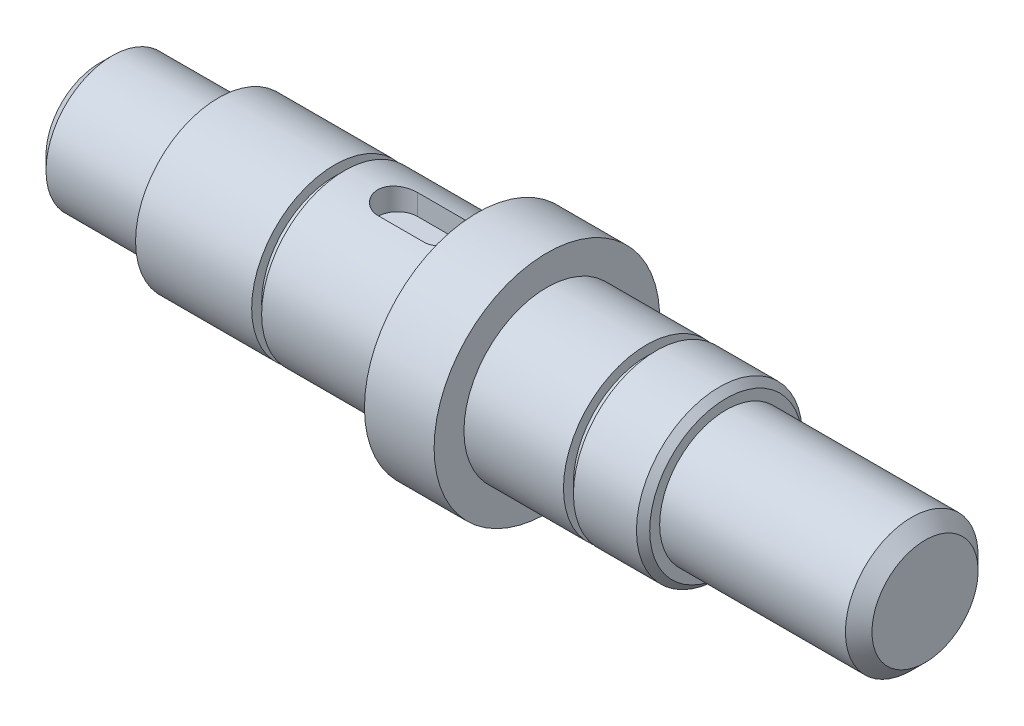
ISO-10303-21;
HEADER;
FILE_DESCRIPTION(('STEP AP214'),'2;1');
FILE_NAME('part.step','',(''),(''),'','','');
FILE_SCHEMA(('AUTOMOTIVE_DESIGN { 1 0 10303 214 1 1 1 1 }'));
ENDSEC;
DATA;
#1=APPLICATION_CONTEXT('core data for automotive mechanical design processes');
#2=APPLICATION_PROTOCOL_DEFINITION('international standard','automotive_design',2000,#1);
#3=PRODUCT_CONTEXT('',#1,'mechanical');
#4=PRODUCT('Part','Part','',(#3));
#5=PRODUCT_RELATED_PRODUCT_CATEGORY('part','',(#4));
#6=PRODUCT_DEFINITION_FORMATION('','',#4);
#7=PRODUCT_DEFINITION_CONTEXT('part definition',#1,'design');
#8=PRODUCT_DEFINITION('design','',#6,#7);
#9=PRODUCT_DEFINITION_SHAPE('','',#8);
#10=(LENGTH_UNIT() NAMED_UNIT(*) SI_UNIT(.MILLI.,.METRE.));
#11=(NAMED_UNIT(*) PLANE_ANGLE_UNIT() SI_UNIT($,.RADIAN.));
#12=(NAMED_UNIT(*) SI_UNIT($,.STERADIAN.) SOLID_ANGLE_UNIT());
#13=UNCERTAINTY_MEASURE_WITH_UNIT(LENGTH_MEASURE(1.E-05),#10,'distance_accuracy_value','');
#14=(GEOMETRIC_REPRESENTATION_CONTEXT(3) GLOBAL_UNCERTAINTY_ASSIGNED_CONTEXT((#13)) GLOBAL_UNIT_ASSIGNED_CONTEXT((#10,
#11,#12)) REPRESENTATION_CONTEXT('',''));
#15=CARTESIAN_POINT('',(0.,0.,0.));
#16=DIRECTION('',(0.,0.,1.));
#17=DIRECTION('',(1.,0.,0.));
#18=AXIS2_PLACEMENT_3D('',#15,#16,#17);
#19=CARTESIAN_POINT('',(-69.5,0.,0.));
#20=DIRECTION('',(1.,0.,0.));
#21=DIRECTION('',(0.,0.,-1.));
#22=AXIS2_PLACEMENT_3D('',#19,#20,#21);
#23=PLANE('',#22);
#24=CARTESIAN_POINT('',(-69.5,0.,0.));
#25=DIRECTION('',(1.,0.,0.));
#26=DIRECTION('',(0.,0.,-1.));
#27=AXIS2_PLACEMENT_3D('',#24,#25,#26);
#28=CIRCLE('',#27,7.99999999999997);
#29=CARTESIAN_POINT('',(-69.5,0.,-7.99999999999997));
#30=VERTEX_POINT('',#29);
#31=EDGE_CURVE('E150',#30,#30,#28,.F.);
#32=ORIENTED_EDGE('',*,*,#31,.T.);
#33=EDGE_LOOP('',(#32));
#34=FACE_BOUND('',#33,.T.);
#35=ADVANCED_FACE('F33',(#34),#23,.F.);
#36=CARTESIAN_POINT('',(-69.5,0.,0.));
#37=DIRECTION('',(-1.,0.,0.));
#38=DIRECTION('',(0.,0.,1.));
#39=AXIS2_PLACEMENT_3D('',#36,#37,#38);
#40=CYLINDRICAL_SURFACE('',#39,10.);
#41=CARTESIAN_POINT('',(-67.5,0.,0.));
#42=DIRECTION('',(1.,0.,0.));
#43=DIRECTION('',(0.,0.,-1.));
#44=AXIS2_PLACEMENT_3D('',#41,#42,#43);
#45=CIRCLE('',#44,10.);
#46=CARTESIAN_POINT('',(-67.5,0.,-10.));
#47=VERTEX_POINT('',#46);
#48=EDGE_CURVE('E153',#47,#47,#45,.T.);
#49=ORIENTED_EDGE('',*,*,#48,.T.);
#50=EDGE_LOOP('',(#49));
#51=FACE_BOUND('',#50,.T.);
#52=CARTESIAN_POINT('',(-51.5,0.,0.));
#53=DIRECTION('',(-1.,0.,0.));
#54=DIRECTION('',(0.,0.,1.));
#55=AXIS2_PLACEMENT_3D('',#52,#53,#54);
#56=CIRCLE('',#55,10.);
#57=CARTESIAN_POINT('',(-51.5,0.,10.));
#58=VERTEX_POINT('',#57);
#59=EDGE_CURVE('E147',#58,#58,#56,.T.);
#60=ORIENTED_EDGE('',*,*,#59,.T.);
#61=EDGE_LOOP('',(#60));
#62=FACE_BOUND('',#61,.T.);
#63=ADVANCED_FACE('F254',(#51,#62),#40,.T.);
#64=CARTESIAN_POINT('',(-51.5,10.,0.));
#65=DIRECTION('',(1.,0.,0.));
#66=DIRECTION('',(0.,0.,-1.));
#67=AXIS2_PLACEMENT_3D('',#64,#65,#66);
#68=PLANE('',#67);
#69=ORIENTED_EDGE('',*,*,#59,.F.);
#70=EDGE_LOOP('',(#69));
#71=FACE_BOUND('',#70,.T.);
#72=CARTESIAN_POINT('',(-51.5,0.,0.));
#73=DIRECTION('',(-1.,0.,0.));
#74=DIRECTION('',(0.,0.,1.));
#75=AXIS2_PLACEMENT_3D('',#72,#73,#74);
#76=CIRCLE('',#75,12.5);
#77=CARTESIAN_POINT('',(-51.5,0.,12.5));
#78=VERTEX_POINT('',#77);
#79=EDGE_CURVE('E144',#78,#78,#76,.T.);
#80=ORIENTED_EDGE('',*,*,#79,.T.);
#81=EDGE_LOOP('',(#80));
#82=FACE_BOUND('',#81,.T.);
#83=ADVANCED_FACE('F259',(#71,#82),#68,.F.);
#84=CARTESIAN_POINT('',(-69.5,0.,0.));
#85=DIRECTION('',(-1.,0.,0.));
#86=DIRECTION('',(0.,0.,1.));
#87=AXIS2_PLACEMENT_3D('',#84,#85,#86);
#88=CYLINDRICAL_SURFACE('',#87,12.5);
#89=ORIENTED_EDGE('',*,*,#79,.F.);
#90=EDGE_LOOP('',(#89));
#91=FACE_BOUND('',#90,.T.);
#92=CARTESIAN_POINT('',(-34.,0.,0.));
#93=DIRECTION('',(-1.,0.,0.));
#94=DIRECTION('',(0.,0.,1.));
#95=AXIS2_PLACEMENT_3D('',#92,#93,#94);
#96=CIRCLE('',#95,12.5);
#97=CARTESIAN_POINT('',(-34.,0.,12.5));
#98=VERTEX_POINT('',#97);
#99=EDGE_CURVE('E141',#98,#98,#96,.T.);
#100=ORIENTED_EDGE('',*,*,#99,.T.);
#101=EDGE_LOOP('',(#100));
#102=FACE_BOUND('',#101,.T.);
#103=ADVANCED_FACE('F266',(#91,#102),#88,.T.);
#104=CARTESIAN_POINT('',(-34.,11.,0.));
#105=DIRECTION('',(-1.,0.,0.));
#106=DIRECTION('',(0.,0.,1.));
#107=AXIS2_PLACEMENT_3D('',#104,#105,#106);
#108=PLANE('',#107);
#109=ORIENTED_EDGE('',*,*,#99,.F.);
#110=EDGE_LOOP('',(#109));
#111=FACE_BOUND('',#110,.T.);
#112=CARTESIAN_POINT('',(-34.,0.,0.));
#113=DIRECTION('',(-1.,0.,0.));
#114=DIRECTION('',(0.,0.,1.));
#115=AXIS2_PLACEMENT_3D('',#112,#113,#114);
#116=CIRCLE('',#115,11.);
#117=CARTESIAN_POINT('',(-34.,0.,11.));
#118=VERTEX_POINT('',#117);
#119=EDGE_CURVE('E138',#118,#118,#116,.T.);
#120=ORIENTED_EDGE('',*,*,#119,.T.);
#121=EDGE_LOOP('',(#120));
#122=FACE_BOUND('',#121,.T.);
#123=ADVANCED_FACE('F273',(#111,#122),#108,.F.);
#124=CARTESIAN_POINT('',(-69.5,0.,0.));
#125=DIRECTION('',(-1.,0.,0.));
#126=DIRECTION('',(0.,0.,1.));
#127=AXIS2_PLACEMENT_3D('',#124,#125,#126);
#128=CYLINDRICAL_SURFACE('',#127,11.);
#129=ORIENTED_EDGE('',*,*,#119,.F.);
#130=EDGE_LOOP('',(#129));
#131=FACE_BOUND('',#130,.T.);
#132=CARTESIAN_POINT('',(-32.5,0.,0.));
#133=DIRECTION('',(-1.,0.,0.));
#134=DIRECTION('',(0.,0.,1.));
#135=AXIS2_PLACEMENT_3D('',#132,#133,#134);
#136=CIRCLE('',#135,11.);
#137=CARTESIAN_POINT('',(-32.5,0.,11.));
#138=VERTEX_POINT('',#137);
#139=EDGE_CURVE('E135',#138,#138,#136,.T.);
#140=ORIENTED_EDGE('',*,*,#139,.T.);
#141=EDGE_LOOP('',(#140));
#142=FACE_BOUND('',#141,.T.);
#143=ADVANCED_FACE('F277',(#131,#142),#128,.T.);
#144=CARTESIAN_POINT('',(-32.5,12.5,0.));
#145=DIRECTION('',(1.,0.,0.));
#146=DIRECTION('',(0.,0.,-1.));
#147=AXIS2_PLACEMENT_3D('',#144,#145,#146);
#148=PLANE('',#147);
#149=ORIENTED_EDGE('',*,*,#139,.F.);
#150=EDGE_LOOP('',(#149));
#151=FACE_BOUND('',#150,.T.);
#152=CARTESIAN_POINT('',(-32.5,0.,0.));
#153=DIRECTION('',(-1.,0.,0.));
#154=DIRECTION('',(0.,0.,1.));
#155=AXIS2_PLACEMENT_3D('',#152,#153,#154);
#156=CIRCLE('',#155,12.5);
#157=CARTESIAN_POINT('',(-32.5,0.,12.5));
#158=VERTEX_POINT('',#157);
#159=EDGE_CURVE('E132',#158,#158,#156,.T.);
#160=ORIENTED_EDGE('',*,*,#159,.T.);
#161=EDGE_LOOP('',(#160));
#162=FACE_BOUND('',#161,.T.);
#163=ADVANCED_FACE('F249',(#151,#162),#148,.F.);
#164=CARTESIAN_POINT('',(-69.5,0.,0.));
#165=DIRECTION('',(-1.,0.,0.));
#166=DIRECTION('',(0.,0.,1.));
#167=AXIS2_PLACEMENT_3D('',#164,#165,#166);
#168=CYLINDRICAL_SURFACE('',#167,12.5);
#169=DIRECTION('',(-1.,0.,0.));
#170=VECTOR('',#169,1.);
#171=CARTESIAN_POINT('',(-69.5,12.1346610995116,-3.));
#172=LINE('',#171,#170);
#173=CARTESIAN_POINT('',(-24.5,12.1346610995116,-3.));
#174=VERTEX_POINT('',#173);
#175=CARTESIAN_POINT('',(-17.5,12.1346610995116,-3.));
#176=VERTEX_POINT('',#175);
#177=EDGE_CURVE('E168',#174,#176,#172,.F.);
#178=ORIENTED_EDGE('',*,*,#177,.T.);
#179=CARTESIAN_POINT('',(-17.5,12.1346610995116,-3.));
#180=CARTESIAN_POINT('',(-17.416922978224,12.1346522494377,-3.00000949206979));
#181=CARTESIAN_POINT('',(-17.3338515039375,12.1355140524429,-2.9965492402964));
#182=CARTESIAN_POINT('',(-17.1683275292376,12.1389133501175,-2.98276295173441));
#183=CARTESIAN_POINT('',(-17.0858749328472,12.1414505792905,-2.97243800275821));
#184=CARTESIAN_POINT('',(-16.9223234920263,12.1481288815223,-2.94502172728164));
#185=CARTESIAN_POINT('',(-16.8412223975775,12.1522669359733,-2.92794313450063));
#186=CARTESIAN_POINT('',(-16.6808118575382,12.1620165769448,-2.88717657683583));
#187=CARTESIAN_POINT('',(-16.6015024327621,12.1676281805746,-2.86348853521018));
#188=CARTESIAN_POINT('',(-16.3670985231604,12.1864398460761,-2.7827647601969));
#189=CARTESIAN_POINT('',(-16.2153717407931,12.2016236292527,-2.71604288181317));
#190=CARTESIAN_POINT('',(-15.9253044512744,12.2355556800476,-2.55882843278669));
#191=CARTESIAN_POINT('',(-15.7869670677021,12.2543047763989,-2.46833033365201));
#192=CARTESIAN_POINT('',(-15.5247427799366,12.2936784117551,-2.26416625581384));
#193=CARTESIAN_POINT('',(-15.4011634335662,12.3143307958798,-2.15010988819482));
#194=CARTESIAN_POINT('',(-15.1746900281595,12.3549430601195,-1.90290471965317));
#195=CARTESIAN_POINT('',(-15.0717992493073,12.3749028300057,-1.76975289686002));
#196=CARTESIAN_POINT('',(-14.8883717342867,12.4121880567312,-1.48603085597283));
#197=CARTESIAN_POINT('',(-14.8081375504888,12.4294765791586,-1.33525974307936));
#198=CARTESIAN_POINT('',(-14.6742706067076,12.4591517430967,-1.0218953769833));
#199=CARTESIAN_POINT('',(-14.6206328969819,12.4715392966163,-0.859304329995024));
#200=CARTESIAN_POINT('',(-14.5424623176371,12.4898199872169,-0.530138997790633));
#201=CARTESIAN_POINT('',(-14.5174033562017,12.4958303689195,-0.363696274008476));
#202=CARTESIAN_POINT('',(-14.4954524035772,12.5010873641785,-0.0288643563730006));
#203=CARTESIAN_POINT('',(-14.4985571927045,12.5003347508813,0.139524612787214));
#204=CARTESIAN_POINT('',(-14.5324637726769,12.4922383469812,0.469819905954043));
#205=CARTESIAN_POINT('',(-14.5626973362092,12.4850297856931,0.631788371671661));
#206=CARTESIAN_POINT('',(-14.6490922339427,12.464987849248,0.948281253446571));
#207=CARTESIAN_POINT('',(-14.7052546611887,12.4521542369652,1.10280535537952));
#208=CARTESIAN_POINT('',(-14.8423876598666,12.4220935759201,1.40155039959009));
#209=CARTESIAN_POINT('',(-14.9235651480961,12.4048300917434,1.54567254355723));
#210=CARTESIAN_POINT('',(-15.1082662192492,12.3677898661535,1.81844702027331));
#211=CARTESIAN_POINT('',(-15.2117928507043,12.3480127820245,1.94709723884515));
#212=CARTESIAN_POINT('',(-15.4413012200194,12.307525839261,2.18865245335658));
#213=CARTESIAN_POINT('',(-15.5677774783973,12.2868050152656,2.30108617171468));
#214=CARTESIAN_POINT('',(-15.8380442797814,12.2472145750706,2.50327463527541));
#215=CARTESIAN_POINT('',(-15.9818395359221,12.2283454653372,2.59302318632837));
#216=CARTESIAN_POINT('',(-16.2835552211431,12.1945549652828,2.74756993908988));
#217=CARTESIAN_POINT('',(-16.4415389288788,12.1796525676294,2.81224875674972));
#218=CARTESIAN_POINT('',(-16.7664841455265,12.1557369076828,2.91390343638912));
#219=CARTESIAN_POINT('',(-16.9334318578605,12.1467148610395,2.95092063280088));
#220=CARTESIAN_POINT('',(-17.1681685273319,12.139016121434,2.98233825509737));
#221=CARTESIAN_POINT('',(-17.2344069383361,12.1373853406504,2.98896283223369));
#222=CARTESIAN_POINT('',(-17.3670865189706,12.1352084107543,2.9977885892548));
#223=CARTESIAN_POINT('',(-17.4335271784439,12.1346604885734,2.99999700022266));
#224=CARTESIAN_POINT('',(-17.5,12.1346610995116,3.));
#225=B_SPLINE_CURVE_WITH_KNOTS('',3,(#179,#180,#181,#182,#183,#184,#185,#186,#187,#188,#189,
#190,#191,#192,#193,#194,#195,#196,#197,#198,#199,#200,#201,#202,#203,#204,#205,#206,#207,#208,
#209,#210,#211,#212,#213,#214,#215,#216,#217,#218,#219,#220,#221,#222,#223,#224),.UNSPECIFIED.,
.F.,.F.,(4,2,2,2,2,2,2,2,2,2,2,2,2,2,2,2,2,2,2,2,2,2,4),(0.,0.249144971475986,0.49825047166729,
0.746888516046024,0.995529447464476,1.49234020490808,1.98926658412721,2.49520478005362,
3.00122312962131,3.51370966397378,4.02610078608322,4.52889907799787,5.03163989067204,
5.52409016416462,6.01656119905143,6.51322041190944,7.00994741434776,7.51903074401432,
8.02825292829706,8.5398711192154,9.05072326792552,9.2503660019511,9.44968157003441),.UNSPECIFIED.);
#226=CARTESIAN_POINT('',(-17.5,12.1346610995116,3.));
#227=VERTEX_POINT('',#226);
#228=EDGE_CURVE('E11',#176,#227,#225,.T.);
#229=ORIENTED_EDGE('',*,*,#228,.T.);
#230=DIRECTION('',(-1.,0.,0.));
#231=VECTOR('',#230,1.);
#232=CARTESIAN_POINT('',(-69.5,12.1346610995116,3.));
#233=LINE('',#232,#231);
#234=CARTESIAN_POINT('',(-24.5,12.1346610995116,3.));
#235=VERTEX_POINT('',#234);
#236=EDGE_CURVE('E45',#227,#235,#233,.T.);
#237=ORIENTED_EDGE('',*,*,#236,.T.);
#238=CARTESIAN_POINT('',(-24.5,12.1346610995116,3.));
#239=CARTESIAN_POINT('',(-24.583077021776,12.1346522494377,3.00000949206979));
#240=CARTESIAN_POINT('',(-24.6661484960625,12.1355140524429,2.9965492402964));
#241=CARTESIAN_POINT('',(-24.8316724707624,12.1389133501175,2.9827629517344));
#242=CARTESIAN_POINT('',(-24.9141250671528,12.1414505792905,2.97243800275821));
#243=CARTESIAN_POINT('',(-25.0776765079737,12.1481288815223,2.94502172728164));
#244=CARTESIAN_POINT('',(-25.1587776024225,12.1522669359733,2.92794313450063));
#245=CARTESIAN_POINT('',(-25.3191881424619,12.1620165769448,2.88717657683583));
#246=CARTESIAN_POINT('',(-25.3984975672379,12.1676281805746,2.86348853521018));
#247=CARTESIAN_POINT('',(-25.6329014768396,12.1864398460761,2.7827647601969));
#248=CARTESIAN_POINT('',(-25.7846282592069,12.2016236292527,2.71604288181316));
#249=CARTESIAN_POINT('',(-26.0746955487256,12.2355556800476,2.55882843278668));
#250=CARTESIAN_POINT('',(-26.2130329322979,12.2543047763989,2.46833033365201));
#251=CARTESIAN_POINT('',(-26.4752572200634,12.2936784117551,2.26416625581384));
#252=CARTESIAN_POINT('',(-26.5988365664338,12.3143307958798,2.15010988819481));
#253=CARTESIAN_POINT('',(-26.8253099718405,12.3549430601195,1.90290471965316));
#254=CARTESIAN_POINT('',(-26.9282007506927,12.3749028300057,1.76975289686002));
#255=CARTESIAN_POINT('',(-27.1116282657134,12.4121880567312,1.48603085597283));
#256=CARTESIAN_POINT('',(-27.1918624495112,12.4294765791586,1.33525974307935));
#257=CARTESIAN_POINT('',(-27.3257293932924,12.4591517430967,1.02189537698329));
#258=CARTESIAN_POINT('',(-27.3793671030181,12.4715392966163,0.859304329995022));
#259=CARTESIAN_POINT('',(-27.4575376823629,12.4898199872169,0.530138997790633));
#260=CARTESIAN_POINT('',(-27.4825966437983,12.4958303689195,0.363696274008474));
#261=CARTESIAN_POINT('',(-27.5045475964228,12.5010873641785,0.0288643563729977));
#262=CARTESIAN_POINT('',(-27.5014428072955,12.5003347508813,-0.139524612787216));
#263=CARTESIAN_POINT('',(-27.4675362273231,12.4922383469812,-0.469819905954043));
#264=CARTESIAN_POINT('',(-27.4373026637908,12.4850297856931,-0.631788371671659));
#265=CARTESIAN_POINT('',(-27.3509077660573,12.464987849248,-0.948281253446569));
#266=CARTESIAN_POINT('',(-27.2947453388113,12.4521542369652,-1.10280535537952));
#267=CARTESIAN_POINT('',(-27.1576123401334,12.4220935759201,-1.40155039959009));
#268=CARTESIAN_POINT('',(-27.0764348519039,12.4048300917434,-1.54567254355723));
#269=CARTESIAN_POINT('',(-26.8917337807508,12.3677898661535,-1.81844702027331));
#270=CARTESIAN_POINT('',(-26.7882071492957,12.3480127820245,-1.94709723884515));
#271=CARTESIAN_POINT('',(-26.5586987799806,12.307525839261,-2.18865245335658));
#272=CARTESIAN_POINT('',(-26.4322225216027,12.2868050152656,-2.30108617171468));
#273=CARTESIAN_POINT('',(-26.1619557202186,12.2472145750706,-2.50327463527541));
#274=CARTESIAN_POINT('',(-26.0181604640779,12.2283454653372,-2.59302318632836));
#275=CARTESIAN_POINT('',(-25.7164447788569,12.1945549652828,-2.74756993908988));
#276=CARTESIAN_POINT('',(-25.5584610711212,12.1796525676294,-2.81224875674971));
#277=CARTESIAN_POINT('',(-25.2335158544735,12.1557369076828,-2.91390343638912));
#278=CARTESIAN_POINT('',(-25.0665681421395,12.1467148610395,-2.95092063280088));
#279=CARTESIAN_POINT('',(-24.831831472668,12.139016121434,-2.98233825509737));
#280=CARTESIAN_POINT('',(-24.7655930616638,12.1373853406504,-2.98896283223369));
#281=CARTESIAN_POINT('',(-24.6329134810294,12.1352084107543,-2.9977885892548));
#282=CARTESIAN_POINT('',(-24.5664728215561,12.1346604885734,-2.99999700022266));
#283=CARTESIAN_POINT('',(-24.5,12.1346610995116,-3.));
#284=B_SPLINE_CURVE_WITH_KNOTS('',3,(#238,#239,#240,#241,#242,#243,#244,#245,#246,#247,#248,
#249,#250,#251,#252,#253,#254,#255,#256,#257,#258,#259,#260,#261,#262,#263,#264,#265,#266,#267,
#268,#269,#270,#271,#272,#273,#274,#275,#276,#277,#278,#279,#280,#281,#282,#283),.UNSPECIFIED.,
.F.,.F.,(4,2,2,2,2,2,2,2,2,2,2,2,2,2,2,2,2,2,2,2,2,2,4),(0.,0.249144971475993,0.4982504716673,
0.746888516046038,0.995529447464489,1.49234020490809,1.98926658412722,2.49520478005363,
3.00122312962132,3.51370966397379,4.02610078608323,4.52889907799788,5.03163989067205,
5.52409016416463,6.01656119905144,6.51322041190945,7.00994741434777,7.51903074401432,
8.02825292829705,8.5398711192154,9.05072326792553,9.25036600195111,9.44968157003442),.UNSPECIFIED.);
#285=EDGE_CURVE('E170',#235,#174,#284,.T.);
#286=ORIENTED_EDGE('',*,*,#285,.T.);
#287=EDGE_LOOP('',(#178,#229,#237,#286));
#288=FACE_BOUND('',#287,.T.);
#289=ORIENTED_EDGE('',*,*,#159,.F.);
#290=EDGE_LOOP('',(#289));
#291=FACE_BOUND('',#290,.T.);
#292=CARTESIAN_POINT('',(-12.5,0.,0.));
#293=DIRECTION('',(-1.,0.,0.));
#294=DIRECTION('',(0.,0.,1.));
#295=AXIS2_PLACEMENT_3D('',#292,#293,#294);
#296=CIRCLE('',#295,12.5);
#297=CARTESIAN_POINT('',(-12.5,0.,12.5));
#298=VERTEX_POINT('',#297);
#299=EDGE_CURVE('E129',#298,#298,#296,.T.);
#300=ORIENTED_EDGE('',*,*,#299,.T.);
#301=EDGE_LOOP('',(#300));
#302=FACE_BOUND('',#301,.T.);
#303=ADVANCED_FACE('F176',(#288,#291,#302),#168,.T.);
#304=CARTESIAN_POINT('',(-12.5,12.5,0.));
#305=DIRECTION('',(1.,0.,0.));
#306=DIRECTION('',(0.,0.,-1.));
#307=AXIS2_PLACEMENT_3D('',#304,#305,#306);
#308=PLANE('',#307);
#309=ORIENTED_EDGE('',*,*,#299,.F.);
#310=EDGE_LOOP('',(#309));
#311=FACE_BOUND('',#310,.T.);
#312=CARTESIAN_POINT('',(-12.5,0.,0.));
#313=DIRECTION('',(-1.,0.,0.));
#314=DIRECTION('',(0.,0.,1.));
#315=AXIS2_PLACEMENT_3D('',#312,#313,#314);
#316=CIRCLE('',#315,17.);
#317=CARTESIAN_POINT('',(-12.5,0.,17.));
#318=VERTEX_POINT('',#317);
#319=EDGE_CURVE('E126',#318,#318,#316,.T.);
#320=ORIENTED_EDGE('',*,*,#319,.T.);
#321=EDGE_LOOP('',(#320));
#322=FACE_BOUND('',#321,.T.);
#323=ADVANCED_FACE('F242',(#311,#322),#308,.F.);
#324=CARTESIAN_POINT('',(-69.5,0.,0.));
#325=DIRECTION('',(-1.,0.,0.));
#326=DIRECTION('',(0.,0.,1.));
#327=AXIS2_PLACEMENT_3D('',#324,#325,#326);
#328=CYLINDRICAL_SURFACE('',#327,17.);
#329=ORIENTED_EDGE('',*,*,#319,.F.);
#330=EDGE_LOOP('',(#329));
#331=FACE_BOUND('',#330,.T.);
#332=CARTESIAN_POINT('',(-2.,0.,0.));
#333=DIRECTION('',(-1.,0.,0.));
#334=DIRECTION('',(0.,0.,1.));
#335=AXIS2_PLACEMENT_3D('',#332,#333,#334);
#336=CIRCLE('',#335,17.);
#337=CARTESIAN_POINT('',(-2.,0.,17.));
#338=VERTEX_POINT('',#337);
#339=EDGE_CURVE('E123',#338,#338,#336,.T.);
#340=ORIENTED_EDGE('',*,*,#339,.T.);
#341=EDGE_LOOP('',(#340));
#342=FACE_BOUND('',#341,.T.);
#343=ADVANCED_FACE('F239',(#331,#342),#328,.T.);
#344=CARTESIAN_POINT('',(-2.,17.,0.));
#345=DIRECTION('',(-1.,0.,0.));
#346=DIRECTION('',(0.,0.,1.));
#347=AXIS2_PLACEMENT_3D('',#344,#345,#346);
#348=PLANE('',#347);
#349=ORIENTED_EDGE('',*,*,#339,.F.);
#350=EDGE_LOOP('',(#349));
#351=FACE_BOUND('',#350,.T.);
#352=CARTESIAN_POINT('',(-2.,0.,0.));
#353=DIRECTION('',(-1.,0.,0.));
#354=DIRECTION('',(0.,0.,1.));
#355=AXIS2_PLACEMENT_3D('',#352,#353,#354);
#356=CIRCLE('',#355,12.5);
#357=CARTESIAN_POINT('',(-2.,0.,12.5));
#358=VERTEX_POINT('',#357);
#359=EDGE_CURVE('E120',#358,#358,#356,.T.);
#360=ORIENTED_EDGE('',*,*,#359,.T.);
#361=EDGE_LOOP('',(#360));
#362=FACE_BOUND('',#361,.T.);
#363=ADVANCED_FACE('F235',(#351,#362),#348,.F.);
#364=CARTESIAN_POINT('',(-69.5,0.,0.));
#365=DIRECTION('',(-1.,0.,0.));
#366=DIRECTION('',(0.,0.,1.));
#367=AXIS2_PLACEMENT_3D('',#364,#365,#366);
#368=CYLINDRICAL_SURFACE('',#367,12.5);
#369=ORIENTED_EDGE('',*,*,#359,.F.);
#370=EDGE_LOOP('',(#369));
#371=FACE_BOUND('',#370,.T.);
#372=CARTESIAN_POINT('',(13.,0.,0.));
#373=DIRECTION('',(-1.,0.,0.));
#374=DIRECTION('',(0.,0.,1.));
#375=AXIS2_PLACEMENT_3D('',#372,#373,#374);
#376=CIRCLE('',#375,12.5);
#377=CARTESIAN_POINT('',(13.,0.,12.5));
#378=VERTEX_POINT('',#377);
#379=EDGE_CURVE('E117',#378,#378,#376,.T.);
#380=ORIENTED_EDGE('',*,*,#379,.T.);
#381=EDGE_LOOP('',(#380));
#382=FACE_BOUND('',#381,.T.);
#383=ADVANCED_FACE('F231',(#371,#382),#368,.T.);
#384=CARTESIAN_POINT('',(13.,12.5,0.));
#385=DIRECTION('',(-1.,0.,0.));
#386=DIRECTION('',(0.,0.,1.));
#387=AXIS2_PLACEMENT_3D('',#384,#385,#386);
#388=PLANE('',#387);
#389=ORIENTED_EDGE('',*,*,#379,.F.);
#390=EDGE_LOOP('',(#389));
#391=FACE_BOUND('',#390,.T.);
#392=CARTESIAN_POINT('',(13.,0.,0.));
#393=DIRECTION('',(-1.,0.,0.));
#394=DIRECTION('',(0.,0.,1.));
#395=AXIS2_PLACEMENT_3D('',#392,#393,#394);
#396=CIRCLE('',#395,11.);
#397=CARTESIAN_POINT('',(13.,0.,11.));
#398=VERTEX_POINT('',#397);
#399=EDGE_CURVE('E114',#398,#398,#396,.T.);
#400=ORIENTED_EDGE('',*,*,#399,.T.);
#401=EDGE_LOOP('',(#400));
#402=FACE_BOUND('',#401,.T.);
#403=ADVANCED_FACE('F227',(#391,#402),#388,.F.);
#404=CARTESIAN_POINT('',(-69.5,0.,0.));
#405=DIRECTION('',(-1.,0.,0.));
#406=DIRECTION('',(0.,0.,1.));
#407=AXIS2_PLACEMENT_3D('',#404,#405,#406);
#408=CYLINDRICAL_SURFACE('',#407,11.);
#409=ORIENTED_EDGE('',*,*,#399,.F.);
#410=EDGE_LOOP('',(#409));
#411=FACE_BOUND('',#410,.T.);
#412=CARTESIAN_POINT('',(14.5,0.,0.));
#413=DIRECTION('',(-1.,0.,0.));
#414=DIRECTION('',(0.,0.,1.));
#415=AXIS2_PLACEMENT_3D('',#412,#413,#414);
#416=CIRCLE('',#415,11.);
#417=CARTESIAN_POINT('',(14.5,0.,11.));
#418=VERTEX_POINT('',#417);
#419=EDGE_CURVE('E111',#418,#418,#416,.T.);
#420=ORIENTED_EDGE('',*,*,#419,.T.);
#421=EDGE_LOOP('',(#420));
#422=FACE_BOUND('',#421,.T.);
#423=ADVANCED_FACE('F223',(#411,#422),#408,.T.);
#424=CARTESIAN_POINT('',(14.5,12.5,0.));
#425=DIRECTION('',(1.,0.,0.));
#426=DIRECTION('',(0.,0.,-1.));
#427=AXIS2_PLACEMENT_3D('',#424,#425,#426);
#428=PLANE('',#427);
#429=ORIENTED_EDGE('',*,*,#419,.F.);
#430=EDGE_LOOP('',(#429));
#431=FACE_BOUND('',#430,.T.);
#432=CARTESIAN_POINT('',(14.5,0.,0.));
#433=DIRECTION('',(-1.,0.,0.));
#434=DIRECTION('',(0.,0.,1.));
#435=AXIS2_PLACEMENT_3D('',#432,#433,#434);
#436=CIRCLE('',#435,12.5);
#437=CARTESIAN_POINT('',(14.5,0.,12.5));
#438=VERTEX_POINT('',#437);
#439=EDGE_CURVE('E108',#438,#438,#436,.T.);
#440=ORIENTED_EDGE('',*,*,#439,.T.);
#441=EDGE_LOOP('',(#440));
#442=FACE_BOUND('',#441,.T.);
#443=ADVANCED_FACE('F219',(#431,#442),#428,.F.);
#444=CARTESIAN_POINT('',(-69.5,0.,0.));
#445=DIRECTION('',(-1.,0.,0.));
#446=DIRECTION('',(0.,0.,1.));
#447=AXIS2_PLACEMENT_3D('',#444,#445,#446);
#448=CYLINDRICAL_SURFACE('',#447,12.5);
#449=CARTESIAN_POINT('',(24.,0.,0.));
#450=DIRECTION('',(-1.,0.,0.));
#451=DIRECTION('',(0.,0.,1.));
#452=AXIS2_PLACEMENT_3D('',#449,#450,#451);
#453=CIRCLE('',#452,12.5);
#454=CARTESIAN_POINT('',(24.,0.,12.5));
#455=VERTEX_POINT('',#454);
#456=EDGE_CURVE('E162',#455,#455,#453,.T.);
#457=ORIENTED_EDGE('',*,*,#456,.T.);
#458=EDGE_LOOP('',(#457));
#459=FACE_BOUND('',#458,.T.);
#460=ORIENTED_EDGE('',*,*,#439,.F.);
#461=EDGE_LOOP('',(#460));
#462=FACE_BOUND('',#461,.T.);
#463=ADVANCED_FACE('F215',(#459,#462),#448,.T.);
#464=CARTESIAN_POINT('',(25.,12.5,0.));
#465=DIRECTION('',(-1.,0.,0.));
#466=DIRECTION('',(0.,0.,1.));
#467=AXIS2_PLACEMENT_3D('',#464,#465,#466);
#468=PLANE('',#467);
#469=CARTESIAN_POINT('',(25.,0.,0.));
#470=DIRECTION('',(-1.,0.,0.));
#471=DIRECTION('',(0.,0.,1.));
#472=AXIS2_PLACEMENT_3D('',#469,#470,#471);
#473=CIRCLE('',#472,11.5);
#474=CARTESIAN_POINT('',(25.,0.,11.5));
#475=VERTEX_POINT('',#474);
#476=EDGE_CURVE('E165',#475,#475,#473,.F.);
#477=ORIENTED_EDGE('',*,*,#476,.T.);
#478=EDGE_LOOP('',(#477));
#479=FACE_BOUND('',#478,.T.);
#480=CARTESIAN_POINT('',(25.,0.,0.));
#481=DIRECTION('',(-1.,0.,0.));
#482=DIRECTION('',(0.,0.,1.));
#483=AXIS2_PLACEMENT_3D('',#480,#481,#482);
#484=CIRCLE('',#483,10.);
#485=CARTESIAN_POINT('',(25.,0.,10.));
#486=VERTEX_POINT('',#485);
#487=EDGE_CURVE('E102',#486,#486,#484,.T.);
#488=ORIENTED_EDGE('',*,*,#487,.T.);
#489=EDGE_LOOP('',(#488));
#490=FACE_BOUND('',#489,.T.);
#491=ADVANCED_FACE('F211',(#479,#490),#468,.F.);
#492=CARTESIAN_POINT('',(-69.5,0.,0.));
#493=DIRECTION('',(-1.,0.,0.));
#494=DIRECTION('',(0.,0.,1.));
#495=AXIS2_PLACEMENT_3D('',#492,#493,#494);
#496=CYLINDRICAL_SURFACE('',#495,10.);
#497=CARTESIAN_POINT('',(53.,0.,0.));
#498=DIRECTION('',(-1.,0.,0.));
#499=DIRECTION('',(0.,0.,1.));
#500=AXIS2_PLACEMENT_3D('',#497,#498,#499);
#501=CIRCLE('',#500,10.);
#502=CARTESIAN_POINT('',(53.,0.,10.));
#503=VERTEX_POINT('',#502);
#504=EDGE_CURVE('E156',#503,#503,#501,.T.);
#505=ORIENTED_EDGE('',*,*,#504,.T.);
#506=EDGE_LOOP('',(#505));
#507=FACE_BOUND('',#506,.T.);
#508=ORIENTED_EDGE('',*,*,#487,.F.);
#509=EDGE_LOOP('',(#508));
#510=FACE_BOUND('',#509,.T.);
#511=ADVANCED_FACE('F207',(#507,#510),#496,.T.);
#512=CARTESIAN_POINT('',(55.,10.,0.));
#513=DIRECTION('',(-1.,0.,0.));
#514=DIRECTION('',(0.,0.,1.));
#515=AXIS2_PLACEMENT_3D('',#512,#513,#514);
#516=PLANE('',#515);
#517=CARTESIAN_POINT('',(55.,0.,0.));
#518=DIRECTION('',(-1.,0.,0.));
#519=DIRECTION('',(0.,0.,1.));
#520=AXIS2_PLACEMENT_3D('',#517,#518,#519);
#521=CIRCLE('',#520,7.99999999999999);
#522=CARTESIAN_POINT('',(55.,0.,7.99999999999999));
#523=VERTEX_POINT('',#522);
#524=EDGE_CURVE('E159',#523,#523,#521,.F.);
#525=ORIENTED_EDGE('',*,*,#524,.T.);
#526=EDGE_LOOP('',(#525));
#527=FACE_BOUND('',#526,.T.);
#528=ADVANCED_FACE('F203',(#527),#516,.F.);
#529=CARTESIAN_POINT('',(-69.5,0.,0.));
#530=DIRECTION('',(1.,0.,0.));
#531=DIRECTION('',(0.,0.,-1.));
#532=AXIS2_PLACEMENT_3D('',#529,#530,#531);
#533=CONICAL_SURFACE('',#532,7.99999999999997,0.785398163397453);
#534=ORIENTED_EDGE('',*,*,#48,.F.);
#535=EDGE_LOOP('',(#534));
#536=FACE_BOUND('',#535,.T.);
#537=ORIENTED_EDGE('',*,*,#31,.F.);
#538=EDGE_LOOP('',(#537));
#539=FACE_BOUND('',#538,.T.);
#540=ADVANCED_FACE('F199',(#536,#539),#533,.T.);
#541=CARTESIAN_POINT('',(53.,0.,0.));
#542=DIRECTION('',(-1.,0.,0.));
#543=DIRECTION('',(0.,0.,1.));
#544=AXIS2_PLACEMENT_3D('',#541,#542,#543);
#545=CONICAL_SURFACE('',#544,10.,0.785398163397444);
#546=ORIENTED_EDGE('',*,*,#524,.F.);
#547=EDGE_LOOP('',(#546));
#548=FACE_BOUND('',#547,.T.);
#549=ORIENTED_EDGE('',*,*,#504,.F.);
#550=EDGE_LOOP('',(#549));
#551=FACE_BOUND('',#550,.T.);
#552=ADVANCED_FACE('F195',(#548,#551),#545,.T.);
#553=CARTESIAN_POINT('',(24.,0.,0.));
#554=DIRECTION('',(-1.,0.,0.));
#555=DIRECTION('',(0.,0.,1.));
#556=AXIS2_PLACEMENT_3D('',#553,#554,#555);
#557=CONICAL_SURFACE('',#556,12.5,0.785398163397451);
#558=ORIENTED_EDGE('',*,*,#476,.F.);
#559=EDGE_LOOP('',(#558));
#560=FACE_BOUND('',#559,.T.);
#561=ORIENTED_EDGE('',*,*,#456,.F.);
#562=EDGE_LOOP('',(#561));
#563=FACE_BOUND('',#562,.T.);
#564=ADVANCED_FACE('F192',(#560,#563),#557,.T.);
#565=CARTESIAN_POINT('',(-17.5,9.,0.));
#566=DIRECTION('',(0.,1.,0.));
#567=DIRECTION('',(0.,0.,1.));
#568=AXIS2_PLACEMENT_3D('',#565,#566,#567);
#569=CYLINDRICAL_SURFACE('',#568,3.);
#570=DIRECTION('',(0.,1.,0.));
#571=VECTOR('',#570,1.);
#572=CARTESIAN_POINT('',(-17.5,9.,-3.));
#573=LINE('',#572,#571);
#574=CARTESIAN_POINT('',(-17.5,9.,-3.));
#575=VERTEX_POINT('',#574);
#576=EDGE_CURVE('E52',#575,#176,#573,.T.);
#577=ORIENTED_EDGE('',*,*,#576,.F.);
#578=CARTESIAN_POINT('',(-17.5,9.,0.));
#579=DIRECTION('',(0.,1.,0.));
#580=DIRECTION('',(0.,0.,1.));
#581=AXIS2_PLACEMENT_3D('',#578,#579,#580);
#582=CIRCLE('',#581,3.);
#583=CARTESIAN_POINT('',(-17.5,9.,3.));
#584=VERTEX_POINT('',#583);
#585=EDGE_CURVE('E79',#584,#575,#582,.T.);
#586=ORIENTED_EDGE('',*,*,#585,.F.);
#587=DIRECTION('',(0.,1.,0.));
#588=VECTOR('',#587,1.);
#589=CARTESIAN_POINT('',(-17.5,9.,3.));
#590=LINE('',#589,#588);
#591=EDGE_CURVE('E100',#584,#227,#590,.T.);
#592=ORIENTED_EDGE('',*,*,#591,.T.);
#593=ORIENTED_EDGE('',*,*,#228,.F.);
#594=EDGE_LOOP('',(#577,#586,#592,#593));
#595=FACE_BOUND('',#594,.T.);
#596=ADVANCED_FACE('F77',(#595),#569,.F.);
#597=CARTESIAN_POINT('',(-17.5,9.,3.));
#598=DIRECTION('',(0.,0.,1.));
#599=DIRECTION('',(1.,0.,0.));
#600=AXIS2_PLACEMENT_3D('',#597,#598,#599);
#601=PLANE('',#600);
#602=ORIENTED_EDGE('',*,*,#591,.F.);
#603=DIRECTION('',(1.,0.,0.));
#604=VECTOR('',#603,1.);
#605=CARTESIAN_POINT('',(-17.5,9.,3.));
#606=LINE('',#605,#604);
#607=CARTESIAN_POINT('',(-24.5,9.,3.));
#608=VERTEX_POINT('',#607);
#609=EDGE_CURVE('E83',#608,#584,#606,.T.);
#610=ORIENTED_EDGE('',*,*,#609,.F.);
#611=DIRECTION('',(0.,1.,0.));
#612=VECTOR('',#611,1.);
#613=CARTESIAN_POINT('',(-24.5,9.,3.));
#614=LINE('',#613,#612);
#615=EDGE_CURVE('E103',#608,#235,#614,.T.);
#616=ORIENTED_EDGE('',*,*,#615,.T.);
#617=ORIENTED_EDGE('',*,*,#236,.F.);
#618=EDGE_LOOP('',(#602,#610,#616,#617));
#619=FACE_BOUND('',#618,.T.);
#620=ADVANCED_FACE('F185',(#619),#601,.F.);
#621=CARTESIAN_POINT('',(-24.5,9.,0.));
#622=DIRECTION('',(0.,1.,0.));
#623=DIRECTION('',(0.,0.,1.));
#624=AXIS2_PLACEMENT_3D('',#621,#622,#623);
#625=CYLINDRICAL_SURFACE('',#624,3.);
#626=ORIENTED_EDGE('',*,*,#615,.F.);
#627=CARTESIAN_POINT('',(-24.5,9.,0.));
#628=DIRECTION('',(0.,1.,0.));
#629=DIRECTION('',(0.,0.,1.));
#630=AXIS2_PLACEMENT_3D('',#627,#628,#629);
#631=CIRCLE('',#630,3.);
#632=CARTESIAN_POINT('',(-24.5,9.,-3.));
#633=VERTEX_POINT('',#632);
#634=EDGE_CURVE('E92',#633,#608,#631,.T.);
#635=ORIENTED_EDGE('',*,*,#634,.F.);
#636=DIRECTION('',(0.,1.,0.));
#637=VECTOR('',#636,1.);
#638=CARTESIAN_POINT('',(-24.5,9.,-3.));
#639=LINE('',#638,#637);
#640=EDGE_CURVE('E82',#633,#174,#639,.T.);
#641=ORIENTED_EDGE('',*,*,#640,.T.);
#642=ORIENTED_EDGE('',*,*,#285,.F.);
#643=EDGE_LOOP('',(#626,#635,#641,#642));
#644=FACE_BOUND('',#643,.T.);
#645=ADVANCED_FACE('F180',(#644),#625,.F.);
#646=CARTESIAN_POINT('',(-17.5,9.,-3.));
#647=DIRECTION('',(0.,0.,-1.));
#648=DIRECTION('',(-1.,0.,0.));
#649=AXIS2_PLACEMENT_3D('',#646,#647,#648);
#650=PLANE('',#649);
#651=ORIENTED_EDGE('',*,*,#640,.F.);
#652=DIRECTION('',(-1.,0.,0.));
#653=VECTOR('',#652,1.);
#654=CARTESIAN_POINT('',(-17.5,9.,-3.));
#655=LINE('',#654,#653);
#656=EDGE_CURVE('E86',#575,#633,#655,.T.);
#657=ORIENTED_EDGE('',*,*,#656,.F.);
#658=ORIENTED_EDGE('',*,*,#576,.T.);
#659=ORIENTED_EDGE('',*,*,#177,.F.);
#660=EDGE_LOOP('',(#651,#657,#658,#659));
#661=FACE_BOUND('',#660,.T.);
#662=ADVANCED_FACE('F87',(#661),#650,.F.);
#663=CARTESIAN_POINT('',(-17.5,9.,0.));
#664=DIRECTION('',(0.,1.,0.));
#665=DIRECTION('',(0.,0.,1.));
#666=AXIS2_PLACEMENT_3D('',#663,#664,#665);
#667=PLANE('',#666);
#668=ORIENTED_EDGE('',*,*,#585,.T.);
#669=ORIENTED_EDGE('',*,*,#656,.T.);
#670=ORIENTED_EDGE('',*,*,#634,.T.);
#671=ORIENTED_EDGE('',*,*,#609,.T.);
#672=EDGE_LOOP('',(#668,#669,#670,#671));
#673=FACE_BOUND('',#672,.T.);
#674=ADVANCED_FACE('F94',(#673),#667,.T.);
#675=CLOSED_SHELL('',(#35,#63,#83,#103,#123,#143,#163,#303,#323,#343,#363,#383,#403,#423,#443,
#463,#491,#511,#528,#540,#552,#564,#596,#620,#645,#662,#674));
#676=MANIFOLD_SOLID_BREP('B2',#675);
#677=ADVANCED_BREP_SHAPE_REPRESENTATION('',(#18,#676),#14);
#678=SHAPE_DEFINITION_REPRESENTATION(#9,#677);
ENDSEC;
END-ISO-10303-21;
